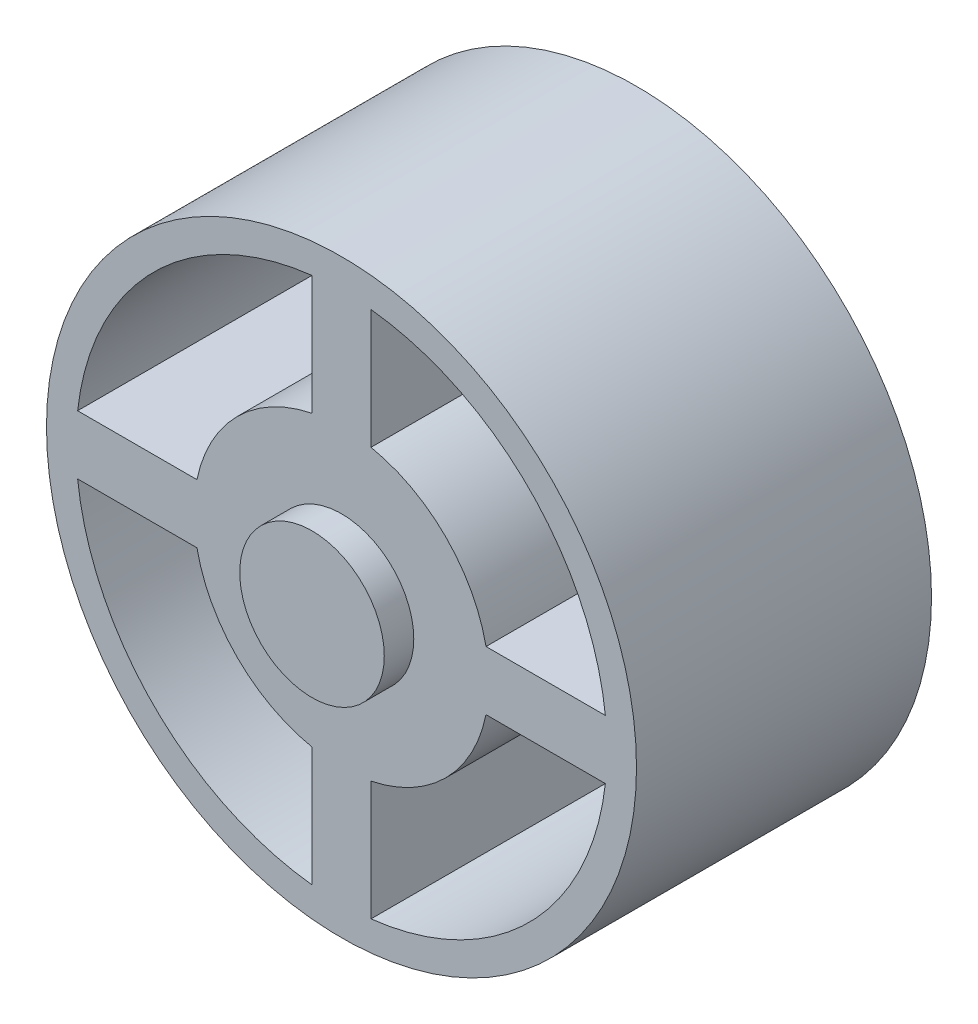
ISO-10303-21;
HEADER;
FILE_DESCRIPTION(('STEP AP214'),'2;1');
FILE_NAME('part.step','',(''),(''),'','','');
FILE_SCHEMA(('AUTOMOTIVE_DESIGN { 1 0 10303 214 1 1 1 1 }'));
ENDSEC;
DATA;
#1=APPLICATION_CONTEXT('core data for automotive mechanical design processes');
#2=APPLICATION_PROTOCOL_DEFINITION('international standard','automotive_design',2000,#1);
#3=PRODUCT_CONTEXT('',#1,'mechanical');
#4=PRODUCT('Part','Part','',(#3));
#5=PRODUCT_RELATED_PRODUCT_CATEGORY('part','',(#4));
#6=PRODUCT_DEFINITION_FORMATION('','',#4);
#7=PRODUCT_DEFINITION_CONTEXT('part definition',#1,'design');
#8=PRODUCT_DEFINITION('design','',#6,#7);
#9=PRODUCT_DEFINITION_SHAPE('','',#8);
#10=(LENGTH_UNIT() NAMED_UNIT(*) SI_UNIT(.MILLI.,.METRE.));
#11=(NAMED_UNIT(*) PLANE_ANGLE_UNIT() SI_UNIT($,.RADIAN.));
#12=(NAMED_UNIT(*) SI_UNIT($,.STERADIAN.) SOLID_ANGLE_UNIT());
#13=UNCERTAINTY_MEASURE_WITH_UNIT(LENGTH_MEASURE(1.E-05),#10,'distance_accuracy_value','');
#14=(GEOMETRIC_REPRESENTATION_CONTEXT(3) GLOBAL_UNCERTAINTY_ASSIGNED_CONTEXT((#13)) GLOBAL_UNIT_ASSIGNED_CONTEXT((#10,
#11,#12)) REPRESENTATION_CONTEXT('',''));
#15=CARTESIAN_POINT('',(0.,0.,0.));
#16=DIRECTION('',(0.,0.,1.));
#17=DIRECTION('',(1.,0.,0.));
#18=AXIS2_PLACEMENT_3D('',#15,#16,#17);
#19=CARTESIAN_POINT('',(0.,0.,100.));
#20=DIRECTION('',(0.,0.,1.));
#21=DIRECTION('',(1.,0.,0.));
#22=AXIS2_PLACEMENT_3D('',#19,#20,#21);
#23=PLANE('',#22);
#24=CARTESIAN_POINT('',(0.,0.,100.));
#25=DIRECTION('',(0.,0.,1.));
#26=DIRECTION('',(1.,0.,0.));
#27=AXIS2_PLACEMENT_3D('',#24,#25,#26);
#28=CIRCLE('',#27,24.5);
#29=CARTESIAN_POINT('',(24.5,0.,100.));
#30=VERTEX_POINT('',#29);
#31=EDGE_CURVE('E11',#30,#30,#28,.T.);
#32=ORIENTED_EDGE('',*,*,#31,.F.);
#33=EDGE_LOOP('',(#32));
#34=FACE_BOUND('',#33,.T.);
#35=CARTESIAN_POINT('',(0.,0.,100.));
#36=DIRECTION('',(0.,0.,1.));
#37=DIRECTION('',(1.,0.,0.));
#38=AXIS2_PLACEMENT_3D('',#35,#36,#37);
#39=CIRCLE('',#38,100.);
#40=CARTESIAN_POINT('',(100.,0.,100.));
#41=VERTEX_POINT('',#40);
#42=EDGE_CURVE('E49',#41,#41,#39,.T.);
#43=ORIENTED_EDGE('',*,*,#42,.T.);
#44=EDGE_LOOP('',(#43));
#45=FACE_BOUND('',#44,.T.);
#46=DIRECTION('',(1.,0.,0.));
#47=VECTOR('',#46,1.);
#48=CARTESIAN_POINT('',(89.4427190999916,9.99999999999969,100.));
#49=LINE('',#48,#47);
#50=CARTESIAN_POINT('',(48.9897948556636,9.99999999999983,100.));
#51=VERTEX_POINT('',#50);
#52=CARTESIAN_POINT('',(89.4427190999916,9.99999999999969,100.));
#53=VERTEX_POINT('',#52);
#54=EDGE_CURVE('E292',#51,#53,#49,.T.);
#55=ORIENTED_EDGE('',*,*,#54,.F.);
#56=CARTESIAN_POINT('',(0.,0.,100.));
#57=DIRECTION('',(0.,0.,-1.));
#58=DIRECTION('',(1.,0.,0.));
#59=AXIS2_PLACEMENT_3D('',#56,#57,#58);
#60=CIRCLE('',#59,50.);
#61=CARTESIAN_POINT('',(10.,48.9897948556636,100.));
#62=VERTEX_POINT('',#61);
#63=EDGE_CURVE('E289',#62,#51,#60,.T.);
#64=ORIENTED_EDGE('',*,*,#63,.F.);
#65=DIRECTION('',(0.,-1.,0.));
#66=VECTOR('',#65,1.);
#67=CARTESIAN_POINT('',(10.,89.4427190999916,100.));
#68=LINE('',#67,#66);
#69=CARTESIAN_POINT('',(10.,89.4427190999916,100.));
#70=VERTEX_POINT('',#69);
#71=EDGE_CURVE('E300',#70,#62,#68,.T.);
#72=ORIENTED_EDGE('',*,*,#71,.F.);
#73=CARTESIAN_POINT('',(0.,0.,100.));
#74=DIRECTION('',(0.,0.,1.));
#75=DIRECTION('',(1.,0.,0.));
#76=AXIS2_PLACEMENT_3D('',#73,#74,#75);
#77=CIRCLE('',#76,90.);
#78=EDGE_CURVE('E296',#53,#70,#77,.T.);
#79=ORIENTED_EDGE('',*,*,#78,.F.);
#80=EDGE_LOOP('',(#55,#64,#72,#79));
#81=FACE_BOUND('',#80,.T.);
#82=DIRECTION('',(0.,1.,0.));
#83=VECTOR('',#82,1.);
#84=CARTESIAN_POINT('',(-10.,89.4427190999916,100.));
#85=LINE('',#84,#83);
#86=CARTESIAN_POINT('',(-10.,48.9897948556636,100.));
#87=VERTEX_POINT('',#86);
#88=CARTESIAN_POINT('',(-10.,89.4427190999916,100.));
#89=VERTEX_POINT('',#88);
#90=EDGE_CURVE('E249',#87,#89,#85,.T.);
#91=ORIENTED_EDGE('',*,*,#90,.F.);
#92=CARTESIAN_POINT('',(0.,0.,100.));
#93=DIRECTION('',(0.,0.,-1.));
#94=DIRECTION('',(1.,0.,0.));
#95=AXIS2_PLACEMENT_3D('',#92,#93,#94);
#96=CIRCLE('',#95,50.);
#97=CARTESIAN_POINT('',(-48.9897948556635,10.0000000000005,100.));
#98=VERTEX_POINT('',#97);
#99=EDGE_CURVE('E246',#98,#87,#96,.T.);
#100=ORIENTED_EDGE('',*,*,#99,.F.);
#101=DIRECTION('',(1.,0.,0.));
#102=VECTOR('',#101,1.);
#103=CARTESIAN_POINT('',(-89.4427190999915,10.0000000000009,100.));
#104=LINE('',#103,#102);
#105=CARTESIAN_POINT('',(-89.4427190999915,10.0000000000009,100.));
#106=VERTEX_POINT('',#105);
#107=EDGE_CURVE('E257',#106,#98,#104,.T.);
#108=ORIENTED_EDGE('',*,*,#107,.F.);
#109=CARTESIAN_POINT('',(0.,0.,100.));
#110=DIRECTION('',(0.,0.,1.));
#111=DIRECTION('',(1.,0.,0.));
#112=AXIS2_PLACEMENT_3D('',#109,#110,#111);
#113=CIRCLE('',#112,90.);
#114=EDGE_CURVE('E253',#89,#106,#113,.T.);
#115=ORIENTED_EDGE('',*,*,#114,.F.);
#116=EDGE_LOOP('',(#91,#100,#108,#115));
#117=FACE_BOUND('',#116,.T.);
#118=DIRECTION('',(0.,-1.,0.));
#119=VECTOR('',#118,1.);
#120=CARTESIAN_POINT('',(9.99999999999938,-89.4427190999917,100.));
#121=LINE('',#120,#119);
#122=CARTESIAN_POINT('',(9.99999999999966,-48.9897948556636,100.));
#123=VERTEX_POINT('',#122);
#124=CARTESIAN_POINT('',(9.99999999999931,-89.4427190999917,100.));
#125=VERTEX_POINT('',#124);
#126=EDGE_CURVE('E206',#123,#125,#121,.T.);
#127=ORIENTED_EDGE('',*,*,#126,.F.);
#128=CARTESIAN_POINT('',(0.,0.,100.));
#129=DIRECTION('',(0.,0.,-1.));
#130=DIRECTION('',(1.,0.,0.));
#131=AXIS2_PLACEMENT_3D('',#128,#129,#130);
#132=CIRCLE('',#131,50.);
#133=CARTESIAN_POINT('',(48.9897948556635,-10.0000000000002,100.));
#134=VERTEX_POINT('',#133);
#135=EDGE_CURVE('E203',#134,#123,#132,.T.);
#136=ORIENTED_EDGE('',*,*,#135,.F.);
#137=DIRECTION('',(-1.,0.,0.));
#138=VECTOR('',#137,1.);
#139=CARTESIAN_POINT('',(89.4427190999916,-10.0000000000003,100.));
#140=LINE('',#139,#138);
#141=CARTESIAN_POINT('',(89.4427190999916,-10.0000000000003,100.));
#142=VERTEX_POINT('',#141);
#143=EDGE_CURVE('E214',#142,#134,#140,.T.);
#144=ORIENTED_EDGE('',*,*,#143,.F.);
#145=CARTESIAN_POINT('',(0.,0.,100.));
#146=DIRECTION('',(0.,0.,1.));
#147=DIRECTION('',(1.,0.,0.));
#148=AXIS2_PLACEMENT_3D('',#145,#146,#147);
#149=CIRCLE('',#148,90.);
#150=EDGE_CURVE('E210',#125,#142,#149,.T.);
#151=ORIENTED_EDGE('',*,*,#150,.F.);
#152=EDGE_LOOP('',(#127,#136,#144,#151));
#153=FACE_BOUND('',#152,.T.);
#154=DIRECTION('',(-1.,0.,0.));
#155=VECTOR('',#154,1.);
#156=CARTESIAN_POINT('',(-89.4427190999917,-9.99999999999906,100.));
#157=LINE('',#156,#155);
#158=CARTESIAN_POINT('',(-48.9897948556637,-9.99999999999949,100.));
#159=VERTEX_POINT('',#158);
#160=CARTESIAN_POINT('',(-89.4427190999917,-9.99999999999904,100.));
#161=VERTEX_POINT('',#160);
#162=EDGE_CURVE('E164',#159,#161,#157,.T.);
#163=ORIENTED_EDGE('',*,*,#162,.F.);
#164=CARTESIAN_POINT('',(0.,0.,100.));
#165=DIRECTION('',(0.,0.,-1.));
#166=DIRECTION('',(1.,0.,0.));
#167=AXIS2_PLACEMENT_3D('',#164,#165,#166);
#168=CIRCLE('',#167,50.);
#169=CARTESIAN_POINT('',(-10.0000000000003,-48.9897948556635,100.));
#170=VERTEX_POINT('',#169);
#171=EDGE_CURVE('E155',#170,#159,#168,.T.);
#172=ORIENTED_EDGE('',*,*,#171,.F.);
#173=DIRECTION('',(0.,1.,0.));
#174=VECTOR('',#173,1.);
#175=CARTESIAN_POINT('',(-10.0000000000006,-89.4427190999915,100.));
#176=LINE('',#175,#174);
#177=CARTESIAN_POINT('',(-10.0000000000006,-89.4427190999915,100.));
#178=VERTEX_POINT('',#177);
#179=EDGE_CURVE('E181',#178,#170,#176,.T.);
#180=ORIENTED_EDGE('',*,*,#179,.F.);
#181=CARTESIAN_POINT('',(0.,0.,100.));
#182=DIRECTION('',(0.,0.,1.));
#183=DIRECTION('',(1.,0.,0.));
#184=AXIS2_PLACEMENT_3D('',#181,#182,#183);
#185=CIRCLE('',#184,90.);
#186=EDGE_CURVE('E177',#161,#178,#185,.T.);
#187=ORIENTED_EDGE('',*,*,#186,.F.);
#188=EDGE_LOOP('',(#163,#172,#180,#187));
#189=FACE_BOUND('',#188,.T.);
#190=ADVANCED_FACE('F39',(#34,#45,#81,#117,#153,#189),#23,.T.);
#191=CARTESIAN_POINT('',(0.,0.,0.));
#192=DIRECTION('',(0.,0.,1.));
#193=DIRECTION('',(1.,0.,0.));
#194=AXIS2_PLACEMENT_3D('',#191,#192,#193);
#195=PLANE('',#194);
#196=CARTESIAN_POINT('',(0.,0.,0.));
#197=DIRECTION('',(0.,0.,1.));
#198=DIRECTION('',(1.,0.,0.));
#199=AXIS2_PLACEMENT_3D('',#196,#197,#198);
#200=CIRCLE('',#199,24.5);
#201=CARTESIAN_POINT('',(24.5,0.,0.));
#202=VERTEX_POINT('',#201);
#203=EDGE_CURVE('E43',#202,#202,#200,.T.);
#204=ORIENTED_EDGE('',*,*,#203,.T.);
#205=EDGE_LOOP('',(#204));
#206=FACE_BOUND('',#205,.T.);
#207=CARTESIAN_POINT('',(0.,0.,0.));
#208=DIRECTION('',(0.,0.,-1.));
#209=DIRECTION('',(1.,0.,0.));
#210=AXIS2_PLACEMENT_3D('',#207,#208,#209);
#211=CIRCLE('',#210,50.);
#212=CARTESIAN_POINT('',(48.9897948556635,-10.0000000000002,0.));
#213=VERTEX_POINT('',#212);
#214=CARTESIAN_POINT('',(9.99999999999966,-48.9897948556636,0.));
#215=VERTEX_POINT('',#214);
#216=EDGE_CURVE('E173',#213,#215,#211,.T.);
#217=ORIENTED_EDGE('',*,*,#216,.T.);
#218=DIRECTION('',(0.,-1.,0.));
#219=VECTOR('',#218,1.);
#220=CARTESIAN_POINT('',(9.99999999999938,-89.4427190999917,0.));
#221=LINE('',#220,#219);
#222=CARTESIAN_POINT('',(9.99999999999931,-89.4427190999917,0.));
#223=VERTEX_POINT('',#222);
#224=EDGE_CURVE('E221',#215,#223,#221,.T.);
#225=ORIENTED_EDGE('',*,*,#224,.T.);
#226=CARTESIAN_POINT('',(0.,0.,0.));
#227=DIRECTION('',(0.,0.,1.));
#228=DIRECTION('',(1.,0.,0.));
#229=AXIS2_PLACEMENT_3D('',#226,#227,#228);
#230=CIRCLE('',#229,90.);
#231=CARTESIAN_POINT('',(89.4427190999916,-10.0000000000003,0.));
#232=VERTEX_POINT('',#231);
#233=EDGE_CURVE('E225',#223,#232,#230,.T.);
#234=ORIENTED_EDGE('',*,*,#233,.T.);
#235=DIRECTION('',(-1.,0.,0.));
#236=VECTOR('',#235,1.);
#237=CARTESIAN_POINT('',(89.4427190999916,-10.0000000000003,0.));
#238=LINE('',#237,#236);
#239=EDGE_CURVE('E207',#232,#213,#238,.T.);
#240=ORIENTED_EDGE('',*,*,#239,.T.);
#241=EDGE_LOOP('',(#217,#225,#234,#240));
#242=FACE_BOUND('',#241,.T.);
#243=CARTESIAN_POINT('',(0.,0.,0.));
#244=DIRECTION('',(0.,0.,-1.));
#245=DIRECTION('',(1.,0.,0.));
#246=AXIS2_PLACEMENT_3D('',#243,#244,#245);
#247=CIRCLE('',#246,50.);
#248=CARTESIAN_POINT('',(10.,48.9897948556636,0.));
#249=VERTEX_POINT('',#248);
#250=CARTESIAN_POINT('',(48.9897948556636,9.99999999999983,0.));
#251=VERTEX_POINT('',#250);
#252=EDGE_CURVE('E288',#249,#251,#247,.T.);
#253=ORIENTED_EDGE('',*,*,#252,.T.);
#254=DIRECTION('',(1.,0.,0.));
#255=VECTOR('',#254,1.);
#256=CARTESIAN_POINT('',(89.4427190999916,9.99999999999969,0.));
#257=LINE('',#256,#255);
#258=CARTESIAN_POINT('',(89.4427190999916,9.99999999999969,0.));
#259=VERTEX_POINT('',#258);
#260=EDGE_CURVE('E307',#251,#259,#257,.T.);
#261=ORIENTED_EDGE('',*,*,#260,.T.);
#262=CARTESIAN_POINT('',(0.,0.,0.));
#263=DIRECTION('',(0.,0.,1.));
#264=DIRECTION('',(1.,0.,0.));
#265=AXIS2_PLACEMENT_3D('',#262,#263,#264);
#266=CIRCLE('',#265,90.);
#267=CARTESIAN_POINT('',(10.,89.4427190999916,0.));
#268=VERTEX_POINT('',#267);
#269=EDGE_CURVE('E311',#259,#268,#266,.T.);
#270=ORIENTED_EDGE('',*,*,#269,.T.);
#271=DIRECTION('',(0.,-1.,0.));
#272=VECTOR('',#271,1.);
#273=CARTESIAN_POINT('',(10.,89.4427190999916,0.));
#274=LINE('',#273,#272);
#275=EDGE_CURVE('E293',#268,#249,#274,.T.);
#276=ORIENTED_EDGE('',*,*,#275,.T.);
#277=EDGE_LOOP('',(#253,#261,#270,#276));
#278=FACE_BOUND('',#277,.T.);
#279=CARTESIAN_POINT('',(0.,0.,0.));
#280=DIRECTION('',(0.,0.,1.));
#281=DIRECTION('',(1.,0.,0.));
#282=AXIS2_PLACEMENT_3D('',#279,#280,#281);
#283=CIRCLE('',#282,100.);
#284=CARTESIAN_POINT('',(100.,0.,0.));
#285=VERTEX_POINT('',#284);
#286=EDGE_CURVE('E331',#285,#285,#283,.T.);
#287=ORIENTED_EDGE('',*,*,#286,.F.);
#288=EDGE_LOOP('',(#287));
#289=FACE_BOUND('',#288,.T.);
#290=CARTESIAN_POINT('',(0.,0.,0.));
#291=DIRECTION('',(0.,0.,-1.));
#292=DIRECTION('',(1.,0.,0.));
#293=AXIS2_PLACEMENT_3D('',#290,#291,#292);
#294=CIRCLE('',#293,50.);
#295=CARTESIAN_POINT('',(-48.9897948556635,10.0000000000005,0.));
#296=VERTEX_POINT('',#295);
#297=CARTESIAN_POINT('',(-10.,48.9897948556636,0.));
#298=VERTEX_POINT('',#297);
#299=EDGE_CURVE('E245',#296,#298,#294,.T.);
#300=ORIENTED_EDGE('',*,*,#299,.T.);
#301=DIRECTION('',(0.,1.,0.));
#302=VECTOR('',#301,1.);
#303=CARTESIAN_POINT('',(-10.,89.4427190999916,0.));
#304=LINE('',#303,#302);
#305=CARTESIAN_POINT('',(-10.,89.4427190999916,0.));
#306=VERTEX_POINT('',#305);
#307=EDGE_CURVE('E264',#298,#306,#304,.T.);
#308=ORIENTED_EDGE('',*,*,#307,.T.);
#309=CARTESIAN_POINT('',(0.,0.,0.));
#310=DIRECTION('',(0.,0.,1.));
#311=DIRECTION('',(1.,0.,0.));
#312=AXIS2_PLACEMENT_3D('',#309,#310,#311);
#313=CIRCLE('',#312,90.);
#314=CARTESIAN_POINT('',(-89.4427190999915,10.0000000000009,0.));
#315=VERTEX_POINT('',#314);
#316=EDGE_CURVE('E268',#306,#315,#313,.T.);
#317=ORIENTED_EDGE('',*,*,#316,.T.);
#318=DIRECTION('',(1.,0.,0.));
#319=VECTOR('',#318,1.);
#320=CARTESIAN_POINT('',(-89.4427190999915,10.0000000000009,0.));
#321=LINE('',#320,#319);
#322=EDGE_CURVE('E250',#315,#296,#321,.T.);
#323=ORIENTED_EDGE('',*,*,#322,.T.);
#324=EDGE_LOOP('',(#300,#308,#317,#323));
#325=FACE_BOUND('',#324,.T.);
#326=CARTESIAN_POINT('',(0.,0.,0.));
#327=DIRECTION('',(0.,0.,-1.));
#328=DIRECTION('',(1.,0.,0.));
#329=AXIS2_PLACEMENT_3D('',#326,#327,#328);
#330=CIRCLE('',#329,50.);
#331=CARTESIAN_POINT('',(-10.0000000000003,-48.9897948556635,0.));
#332=VERTEX_POINT('',#331);
#333=CARTESIAN_POINT('',(-48.9897948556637,-9.99999999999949,0.));
#334=VERTEX_POINT('',#333);
#335=EDGE_CURVE('E65',#332,#334,#330,.T.);
#336=ORIENTED_EDGE('',*,*,#335,.T.);
#337=DIRECTION('',(-1.,0.,0.));
#338=VECTOR('',#337,1.);
#339=CARTESIAN_POINT('',(-89.4427190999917,-9.99999999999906,0.));
#340=LINE('',#339,#338);
#341=CARTESIAN_POINT('',(-89.4427190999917,-9.99999999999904,0.));
#342=VERTEX_POINT('',#341);
#343=EDGE_CURVE('E171',#334,#342,#340,.T.);
#344=ORIENTED_EDGE('',*,*,#343,.T.);
#345=CARTESIAN_POINT('',(0.,0.,0.));
#346=DIRECTION('',(0.,0.,1.));
#347=DIRECTION('',(1.,0.,0.));
#348=AXIS2_PLACEMENT_3D('',#345,#346,#347);
#349=CIRCLE('',#348,90.);
#350=CARTESIAN_POINT('',(-10.0000000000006,-89.4427190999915,0.));
#351=VERTEX_POINT('',#350);
#352=EDGE_CURVE('E190',#342,#351,#349,.T.);
#353=ORIENTED_EDGE('',*,*,#352,.T.);
#354=DIRECTION('',(0.,1.,0.));
#355=VECTOR('',#354,1.);
#356=CARTESIAN_POINT('',(-10.0000000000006,-89.4427190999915,0.));
#357=LINE('',#356,#355);
#358=EDGE_CURVE('E165',#351,#332,#357,.T.);
#359=ORIENTED_EDGE('',*,*,#358,.T.);
#360=EDGE_LOOP('',(#336,#344,#353,#359));
#361=FACE_BOUND('',#360,.T.);
#362=ADVANCED_FACE('F339',(#206,#242,#278,#289,#325,#361),#195,.F.);
#363=CARTESIAN_POINT('',(0.,0.,100.));
#364=DIRECTION('',(0.,0.,-1.));
#365=DIRECTION('',(-1.,0.,0.));
#366=AXIS2_PLACEMENT_3D('',#363,#364,#365);
#367=CYLINDRICAL_SURFACE('',#366,100.);
#368=ORIENTED_EDGE('',*,*,#42,.F.);
#369=EDGE_LOOP('',(#368));
#370=FACE_BOUND('',#369,.T.);
#371=ORIENTED_EDGE('',*,*,#286,.T.);
#372=EDGE_LOOP('',(#371));
#373=FACE_BOUND('',#372,.T.);
#374=ADVANCED_FACE('F41',(#370,#373),#367,.T.);
#375=CARTESIAN_POINT('',(0.,0.,100.));
#376=DIRECTION('',(0.,0.,-1.));
#377=DIRECTION('',(-1.,0.,0.));
#378=AXIS2_PLACEMENT_3D('',#375,#376,#377);
#379=CYLINDRICAL_SURFACE('',#378,50.);
#380=ORIENTED_EDGE('',*,*,#252,.F.);
#381=DIRECTION('',(0.,0.,-1.));
#382=VECTOR('',#381,1.);
#383=CARTESIAN_POINT('',(10.,48.9897948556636,100.));
#384=LINE('',#383,#382);
#385=EDGE_CURVE('E303',#62,#249,#384,.T.);
#386=ORIENTED_EDGE('',*,*,#385,.F.);
#387=ORIENTED_EDGE('',*,*,#63,.T.);
#388=DIRECTION('',(0.,0.,-1.));
#389=VECTOR('',#388,1.);
#390=CARTESIAN_POINT('',(48.9897948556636,9.99999999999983,100.));
#391=LINE('',#390,#389);
#392=EDGE_CURVE('E327',#51,#251,#391,.T.);
#393=ORIENTED_EDGE('',*,*,#392,.T.);
#394=EDGE_LOOP('',(#380,#386,#387,#393));
#395=FACE_BOUND('',#394,.T.);
#396=ADVANCED_FACE('F368',(#395),#379,.T.);
#397=CARTESIAN_POINT('',(89.4427190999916,9.99999999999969,100.));
#398=DIRECTION('',(0.,1.,0.));
#399=DIRECTION('',(-1.,0.,0.));
#400=AXIS2_PLACEMENT_3D('',#397,#398,#399);
#401=PLANE('',#400);
#402=ORIENTED_EDGE('',*,*,#260,.F.);
#403=ORIENTED_EDGE('',*,*,#392,.F.);
#404=ORIENTED_EDGE('',*,*,#54,.T.);
#405=DIRECTION('',(0.,0.,-1.));
#406=VECTOR('',#405,1.);
#407=CARTESIAN_POINT('',(89.4427190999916,9.99999999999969,100.));
#408=LINE('',#407,#406);
#409=EDGE_CURVE('E324',#53,#259,#408,.T.);
#410=ORIENTED_EDGE('',*,*,#409,.T.);
#411=EDGE_LOOP('',(#402,#403,#404,#410));
#412=FACE_BOUND('',#411,.T.);
#413=ADVANCED_FACE('F371',(#412),#401,.T.);
#414=CARTESIAN_POINT('',(0.,0.,100.));
#415=DIRECTION('',(0.,0.,-1.));
#416=DIRECTION('',(-1.,0.,0.));
#417=AXIS2_PLACEMENT_3D('',#414,#415,#416);
#418=CYLINDRICAL_SURFACE('',#417,90.);
#419=ORIENTED_EDGE('',*,*,#269,.F.);
#420=ORIENTED_EDGE('',*,*,#409,.F.);
#421=ORIENTED_EDGE('',*,*,#78,.T.);
#422=DIRECTION('',(0.,0.,-1.));
#423=VECTOR('',#422,1.);
#424=CARTESIAN_POINT('',(10.,89.4427190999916,100.));
#425=LINE('',#424,#423);
#426=EDGE_CURVE('E321',#70,#268,#425,.T.);
#427=ORIENTED_EDGE('',*,*,#426,.T.);
#428=EDGE_LOOP('',(#419,#420,#421,#427));
#429=FACE_BOUND('',#428,.T.);
#430=ADVANCED_FACE('F375',(#429),#418,.F.);
#431=CARTESIAN_POINT('',(10.,89.4427190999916,100.));
#432=DIRECTION('',(1.,0.,0.));
#433=DIRECTION('',(0.,0.,-1.));
#434=AXIS2_PLACEMENT_3D('',#431,#432,#433);
#435=PLANE('',#434);
#436=ORIENTED_EDGE('',*,*,#275,.F.);
#437=ORIENTED_EDGE('',*,*,#426,.F.);
#438=ORIENTED_EDGE('',*,*,#71,.T.);
#439=ORIENTED_EDGE('',*,*,#385,.T.);
#440=EDGE_LOOP('',(#436,#437,#438,#439));
#441=FACE_BOUND('',#440,.T.);
#442=ADVANCED_FACE('F379',(#441),#435,.T.);
#443=CARTESIAN_POINT('',(0.,0.,100.));
#444=DIRECTION('',(0.,0.,-1.));
#445=DIRECTION('',(-1.,0.,0.));
#446=AXIS2_PLACEMENT_3D('',#443,#444,#445);
#447=CYLINDRICAL_SURFACE('',#446,50.);
#448=ORIENTED_EDGE('',*,*,#299,.F.);
#449=DIRECTION('',(0.,0.,-1.));
#450=VECTOR('',#449,1.);
#451=CARTESIAN_POINT('',(-48.9897948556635,10.0000000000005,100.));
#452=LINE('',#451,#450);
#453=EDGE_CURVE('E260',#98,#296,#452,.T.);
#454=ORIENTED_EDGE('',*,*,#453,.F.);
#455=ORIENTED_EDGE('',*,*,#99,.T.);
#456=DIRECTION('',(0.,0.,-1.));
#457=VECTOR('',#456,1.);
#458=CARTESIAN_POINT('',(-10.,48.9897948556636,100.));
#459=LINE('',#458,#457);
#460=EDGE_CURVE('E284',#87,#298,#459,.T.);
#461=ORIENTED_EDGE('',*,*,#460,.T.);
#462=EDGE_LOOP('',(#448,#454,#455,#461));
#463=FACE_BOUND('',#462,.T.);
#464=ADVANCED_FACE('F383',(#463),#447,.T.);
#465=CARTESIAN_POINT('',(-10.,89.4427190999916,100.));
#466=DIRECTION('',(-1.,0.,0.));
#467=DIRECTION('',(0.,0.,1.));
#468=AXIS2_PLACEMENT_3D('',#465,#466,#467);
#469=PLANE('',#468);
#470=ORIENTED_EDGE('',*,*,#307,.F.);
#471=ORIENTED_EDGE('',*,*,#460,.F.);
#472=ORIENTED_EDGE('',*,*,#90,.T.);
#473=DIRECTION('',(0.,0.,-1.));
#474=VECTOR('',#473,1.);
#475=CARTESIAN_POINT('',(-10.,89.4427190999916,100.));
#476=LINE('',#475,#474);
#477=EDGE_CURVE('E281',#89,#306,#476,.T.);
#478=ORIENTED_EDGE('',*,*,#477,.T.);
#479=EDGE_LOOP('',(#470,#471,#472,#478));
#480=FACE_BOUND('',#479,.T.);
#481=ADVANCED_FACE('F387',(#480),#469,.T.);
#482=CARTESIAN_POINT('',(0.,0.,100.));
#483=DIRECTION('',(0.,0.,-1.));
#484=DIRECTION('',(-1.,0.,0.));
#485=AXIS2_PLACEMENT_3D('',#482,#483,#484);
#486=CYLINDRICAL_SURFACE('',#485,90.);
#487=ORIENTED_EDGE('',*,*,#316,.F.);
#488=ORIENTED_EDGE('',*,*,#477,.F.);
#489=ORIENTED_EDGE('',*,*,#114,.T.);
#490=DIRECTION('',(0.,0.,-1.));
#491=VECTOR('',#490,1.);
#492=CARTESIAN_POINT('',(-89.4427190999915,10.0000000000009,100.));
#493=LINE('',#492,#491);
#494=EDGE_CURVE('E278',#106,#315,#493,.T.);
#495=ORIENTED_EDGE('',*,*,#494,.T.);
#496=EDGE_LOOP('',(#487,#488,#489,#495));
#497=FACE_BOUND('',#496,.T.);
#498=ADVANCED_FACE('F391',(#497),#486,.F.);
#499=CARTESIAN_POINT('',(-89.4427190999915,10.0000000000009,100.));
#500=DIRECTION('',(0.,1.,0.));
#501=DIRECTION('',(-1.,0.,0.));
#502=AXIS2_PLACEMENT_3D('',#499,#500,#501);
#503=PLANE('',#502);
#504=ORIENTED_EDGE('',*,*,#322,.F.);
#505=ORIENTED_EDGE('',*,*,#494,.F.);
#506=ORIENTED_EDGE('',*,*,#107,.T.);
#507=ORIENTED_EDGE('',*,*,#453,.T.);
#508=EDGE_LOOP('',(#504,#505,#506,#507));
#509=FACE_BOUND('',#508,.T.);
#510=ADVANCED_FACE('F395',(#509),#503,.T.);
#511=CARTESIAN_POINT('',(0.,0.,100.));
#512=DIRECTION('',(0.,0.,-1.));
#513=DIRECTION('',(-1.,0.,0.));
#514=AXIS2_PLACEMENT_3D('',#511,#512,#513);
#515=CYLINDRICAL_SURFACE('',#514,50.);
#516=ORIENTED_EDGE('',*,*,#216,.F.);
#517=DIRECTION('',(0.,0.,-1.));
#518=VECTOR('',#517,1.);
#519=CARTESIAN_POINT('',(48.9897948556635,-10.0000000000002,100.));
#520=LINE('',#519,#518);
#521=EDGE_CURVE('E217',#134,#213,#520,.T.);
#522=ORIENTED_EDGE('',*,*,#521,.F.);
#523=ORIENTED_EDGE('',*,*,#135,.T.);
#524=DIRECTION('',(0.,0.,-1.));
#525=VECTOR('',#524,1.);
#526=CARTESIAN_POINT('',(9.99999999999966,-48.9897948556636,100.));
#527=LINE('',#526,#525);
#528=EDGE_CURVE('E241',#123,#215,#527,.T.);
#529=ORIENTED_EDGE('',*,*,#528,.T.);
#530=EDGE_LOOP('',(#516,#522,#523,#529));
#531=FACE_BOUND('',#530,.T.);
#532=ADVANCED_FACE('F399',(#531),#515,.T.);
#533=CARTESIAN_POINT('',(9.99999999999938,-89.4427190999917,100.));
#534=DIRECTION('',(1.,0.,0.));
#535=DIRECTION('',(0.,1.,0.));
#536=AXIS2_PLACEMENT_3D('',#533,#534,#535);
#537=PLANE('',#536);
#538=ORIENTED_EDGE('',*,*,#224,.F.);
#539=ORIENTED_EDGE('',*,*,#528,.F.);
#540=ORIENTED_EDGE('',*,*,#126,.T.);
#541=DIRECTION('',(0.,0.,-1.));
#542=VECTOR('',#541,1.);
#543=CARTESIAN_POINT('',(9.99999999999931,-89.4427190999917,100.));
#544=LINE('',#543,#542);
#545=EDGE_CURVE('E238',#125,#223,#544,.T.);
#546=ORIENTED_EDGE('',*,*,#545,.T.);
#547=EDGE_LOOP('',(#538,#539,#540,#546));
#548=FACE_BOUND('',#547,.T.);
#549=ADVANCED_FACE('F403',(#548),#537,.T.);
#550=CARTESIAN_POINT('',(0.,0.,100.));
#551=DIRECTION('',(0.,0.,-1.));
#552=DIRECTION('',(-1.,0.,0.));
#553=AXIS2_PLACEMENT_3D('',#550,#551,#552);
#554=CYLINDRICAL_SURFACE('',#553,90.);
#555=ORIENTED_EDGE('',*,*,#233,.F.);
#556=ORIENTED_EDGE('',*,*,#545,.F.);
#557=ORIENTED_EDGE('',*,*,#150,.T.);
#558=DIRECTION('',(0.,0.,-1.));
#559=VECTOR('',#558,1.);
#560=CARTESIAN_POINT('',(89.4427190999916,-10.0000000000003,100.));
#561=LINE('',#560,#559);
#562=EDGE_CURVE('E235',#142,#232,#561,.T.);
#563=ORIENTED_EDGE('',*,*,#562,.T.);
#564=EDGE_LOOP('',(#555,#556,#557,#563));
#565=FACE_BOUND('',#564,.T.);
#566=ADVANCED_FACE('F407',(#565),#554,.F.);
#567=CARTESIAN_POINT('',(89.4427190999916,-10.0000000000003,100.));
#568=DIRECTION('',(0.,-1.,0.));
#569=DIRECTION('',(1.,0.,0.));
#570=AXIS2_PLACEMENT_3D('',#567,#568,#569);
#571=PLANE('',#570);
#572=ORIENTED_EDGE('',*,*,#239,.F.);
#573=ORIENTED_EDGE('',*,*,#562,.F.);
#574=ORIENTED_EDGE('',*,*,#143,.T.);
#575=ORIENTED_EDGE('',*,*,#521,.T.);
#576=EDGE_LOOP('',(#572,#573,#574,#575));
#577=FACE_BOUND('',#576,.T.);
#578=ADVANCED_FACE('F411',(#577),#571,.T.);
#579=CARTESIAN_POINT('',(0.,0.,100.));
#580=DIRECTION('',(0.,0.,-1.));
#581=DIRECTION('',(-1.,0.,0.));
#582=AXIS2_PLACEMENT_3D('',#579,#580,#581);
#583=CYLINDRICAL_SURFACE('',#582,50.);
#584=ORIENTED_EDGE('',*,*,#335,.F.);
#585=DIRECTION('',(0.,0.,-1.));
#586=VECTOR('',#585,1.);
#587=CARTESIAN_POINT('',(-10.0000000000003,-48.9897948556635,100.));
#588=LINE('',#587,#586);
#589=EDGE_CURVE('E159',#170,#332,#588,.T.);
#590=ORIENTED_EDGE('',*,*,#589,.F.);
#591=ORIENTED_EDGE('',*,*,#171,.T.);
#592=DIRECTION('',(0.,0.,-1.));
#593=VECTOR('',#592,1.);
#594=CARTESIAN_POINT('',(-48.9897948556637,-9.99999999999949,100.));
#595=LINE('',#594,#593);
#596=EDGE_CURVE('E158',#159,#334,#595,.T.);
#597=ORIENTED_EDGE('',*,*,#596,.T.);
#598=EDGE_LOOP('',(#584,#590,#591,#597));
#599=FACE_BOUND('',#598,.T.);
#600=ADVANCED_FACE('F157',(#599),#583,.T.);
#601=CARTESIAN_POINT('',(-89.4427190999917,-9.99999999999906,100.));
#602=DIRECTION('',(0.,-1.,0.));
#603=DIRECTION('',(1.,0.,0.));
#604=AXIS2_PLACEMENT_3D('',#601,#602,#603);
#605=PLANE('',#604);
#606=ORIENTED_EDGE('',*,*,#343,.F.);
#607=ORIENTED_EDGE('',*,*,#596,.F.);
#608=ORIENTED_EDGE('',*,*,#162,.T.);
#609=DIRECTION('',(0.,0.,-1.));
#610=VECTOR('',#609,1.);
#611=CARTESIAN_POINT('',(-89.4427190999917,-9.99999999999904,100.));
#612=LINE('',#611,#610);
#613=EDGE_CURVE('E174',#161,#342,#612,.T.);
#614=ORIENTED_EDGE('',*,*,#613,.T.);
#615=EDGE_LOOP('',(#606,#607,#608,#614));
#616=FACE_BOUND('',#615,.T.);
#617=ADVANCED_FACE('F168',(#616),#605,.T.);
#618=CARTESIAN_POINT('',(0.,0.,100.));
#619=DIRECTION('',(0.,0.,-1.));
#620=DIRECTION('',(-1.,0.,0.));
#621=AXIS2_PLACEMENT_3D('',#618,#619,#620);
#622=CYLINDRICAL_SURFACE('',#621,90.);
#623=ORIENTED_EDGE('',*,*,#352,.F.);
#624=ORIENTED_EDGE('',*,*,#613,.F.);
#625=ORIENTED_EDGE('',*,*,#186,.T.);
#626=DIRECTION('',(0.,0.,-1.));
#627=VECTOR('',#626,1.);
#628=CARTESIAN_POINT('',(-10.0000000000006,-89.4427190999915,100.));
#629=LINE('',#628,#627);
#630=EDGE_CURVE('E57',#178,#351,#629,.T.);
#631=ORIENTED_EDGE('',*,*,#630,.T.);
#632=EDGE_LOOP('',(#623,#624,#625,#631));
#633=FACE_BOUND('',#632,.T.);
#634=ADVANCED_FACE('F348',(#633),#622,.F.);
#635=CARTESIAN_POINT('',(-10.0000000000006,-89.4427190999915,100.));
#636=DIRECTION('',(-1.,0.,0.));
#637=DIRECTION('',(0.,-1.,0.));
#638=AXIS2_PLACEMENT_3D('',#635,#636,#637);
#639=PLANE('',#638);
#640=ORIENTED_EDGE('',*,*,#358,.F.);
#641=ORIENTED_EDGE('',*,*,#630,.F.);
#642=ORIENTED_EDGE('',*,*,#179,.T.);
#643=ORIENTED_EDGE('',*,*,#589,.T.);
#644=EDGE_LOOP('',(#640,#641,#642,#643));
#645=FACE_BOUND('',#644,.T.);
#646=ADVANCED_FACE('F345',(#645),#639,.T.);
#647=CARTESIAN_POINT('',(0.,0.,-9.99999999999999));
#648=DIRECTION('',(0.,0.,1.));
#649=DIRECTION('',(1.,0.,0.));
#650=AXIS2_PLACEMENT_3D('',#647,#648,#649);
#651=PLANE('',#650);
#652=CARTESIAN_POINT('',(0.,0.,-9.99999999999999));
#653=DIRECTION('',(0.,0.,1.));
#654=DIRECTION('',(1.,0.,0.));
#655=AXIS2_PLACEMENT_3D('',#652,#653,#654);
#656=CIRCLE('',#655,24.5);
#657=CARTESIAN_POINT('',(24.5,0.,-9.99999999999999));
#658=VERTEX_POINT('',#657);
#659=EDGE_CURVE('E485',#658,#658,#656,.T.);
#660=ORIENTED_EDGE('',*,*,#659,.F.);
#661=EDGE_LOOP('',(#660));
#662=FACE_BOUND('',#661,.T.);
#663=ADVANCED_FACE('F347',(#662),#651,.F.);
#664=CARTESIAN_POINT('',(0.,0.,-9.99999999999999));
#665=DIRECTION('',(0.,0.,1.));
#666=DIRECTION('',(1.,0.,0.));
#667=AXIS2_PLACEMENT_3D('',#664,#665,#666);
#668=CYLINDRICAL_SURFACE('',#667,24.5);
#669=ORIENTED_EDGE('',*,*,#659,.T.);
#670=EDGE_LOOP('',(#669));
#671=FACE_BOUND('',#670,.T.);
#672=ORIENTED_EDGE('',*,*,#203,.F.);
#673=EDGE_LOOP('',(#672));
#674=FACE_BOUND('',#673,.T.);
#675=ADVANCED_FACE('F354',(#671,#674),#668,.T.);
#676=ORIENTED_EDGE('',*,*,#31,.T.);
#677=EDGE_LOOP('',(#676));
#678=FACE_BOUND('',#677,.T.);
#679=CARTESIAN_POINT('',(0.,0.,110.));
#680=DIRECTION('',(0.,0.,1.));
#681=DIRECTION('',(1.,0.,0.));
#682=AXIS2_PLACEMENT_3D('',#679,#680,#681);
#683=CIRCLE('',#682,24.5);
#684=CARTESIAN_POINT('',(24.5,0.,110.));
#685=VERTEX_POINT('',#684);
#686=EDGE_CURVE('E482',#685,#685,#683,.T.);
#687=ORIENTED_EDGE('',*,*,#686,.F.);
#688=EDGE_LOOP('',(#687));
#689=FACE_BOUND('',#688,.T.);
#690=ADVANCED_FACE('F458',(#678,#689),#668,.T.);
#691=CARTESIAN_POINT('',(0.,0.,110.));
#692=DIRECTION('',(0.,0.,1.));
#693=DIRECTION('',(1.,0.,0.));
#694=AXIS2_PLACEMENT_3D('',#691,#692,#693);
#695=PLANE('',#694);
#696=ORIENTED_EDGE('',*,*,#686,.T.);
#697=EDGE_LOOP('',(#696));
#698=FACE_BOUND('',#697,.T.);
#699=ADVANCED_FACE('F467',(#698),#695,.T.);
#700=CLOSED_SHELL('',(#190,#362,#374,#396,#413,#430,#442,#464,#481,#498,#510,#532,#549,#566,
#578,#600,#617,#634,#646,#663,#675,#690,#699));
#701=MANIFOLD_SOLID_BREP('B2',#700);
#702=ADVANCED_BREP_SHAPE_REPRESENTATION('',(#18,#701),#14);
#703=SHAPE_DEFINITION_REPRESENTATION(#9,#702);
ENDSEC;
END-ISO-10303-21;
